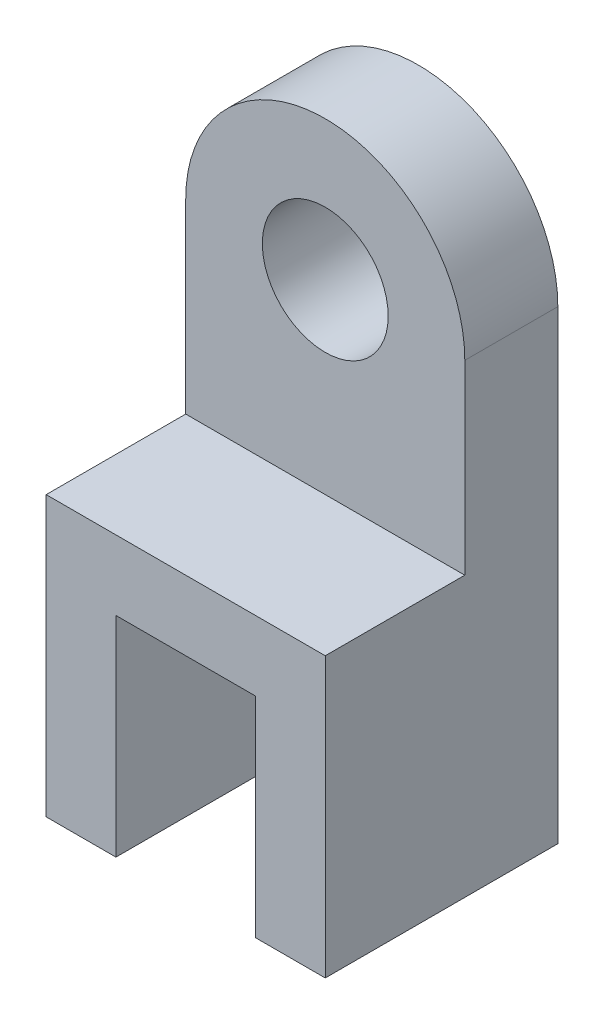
from build123d import *

# Parameters (mm, degrees)
BASE_EXTRUDE_DEPTH  = 10
SKETCH2_W           = 60
SKETCH2_H           = 50
BOSS_EXTRUDE1_DEPTH = 10
SKETCH3_R           = 13.528730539
CUT_EXTRUDE1_DEPTH  = 61
BOSS_EXTRUDE2_DEPTH = 50


with BuildPart() as part:
    # Sketch1 → Base-Extrude (new, symmetric)
    with BuildSketch(Plane.XY):
        with BuildLine():
            Line((-30, -40), (30, -40))
            Line((30, -40), (30, 0))
            ThreePointArc((30, 0), (0, 30), (-30, 0))
            Line((-30, 0), (-30, -40))
        make_face()
    extrude(amount=BASE_EXTRUDE_DEPTH, both=True)

    # Sketch2 → Boss-Extrude1 (add)
    with BuildSketch(Plane.XZ.offset(40)):
        with Locations((0, 15)):
            Rectangle(SKETCH2_W, SKETCH2_H)
    extrude(amount=BOSS_EXTRUDE1_DEPTH)

    # Sketch3 → Cut-Extrude1 (cut)
    with BuildSketch(Plane.XY.offset(10)):
        Circle(SKETCH3_R)
    extrude(amount=-CUT_EXTRUDE1_DEPTH, mode=Mode.SUBTRACT)

    # Sketch7 → Boss-Extrude2 (add)
    with BuildSketch(Plane.XY.offset(40)):
        Polygon((-30, -50), (-30, -100), (-15, -100), (-15, -55), (15, -55), (15, -100), (30, -100), (30, -50), align=None)
    extrude(amount=-BOSS_EXTRUDE2_DEPTH)


solid = part.part
